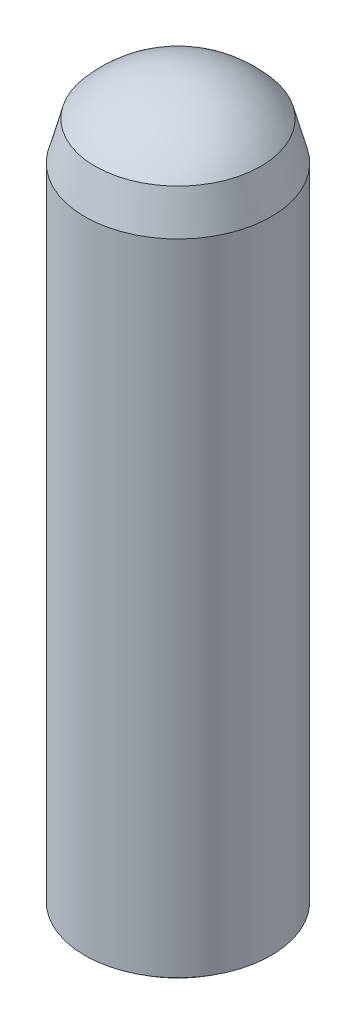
ISO-10303-21;
HEADER;
FILE_DESCRIPTION(('STEP AP214'),'2;1');
FILE_NAME('part.step','',(''),(''),'','','');
FILE_SCHEMA(('AUTOMOTIVE_DESIGN { 1 0 10303 214 1 1 1 1 }'));
ENDSEC;
DATA;
#1=APPLICATION_CONTEXT('core data for automotive mechanical design processes');
#2=APPLICATION_PROTOCOL_DEFINITION('international standard','automotive_design',2000,#1);
#3=PRODUCT_CONTEXT('',#1,'mechanical');
#4=PRODUCT('Part','Part','',(#3));
#5=PRODUCT_RELATED_PRODUCT_CATEGORY('part','',(#4));
#6=PRODUCT_DEFINITION_FORMATION('','',#4);
#7=PRODUCT_DEFINITION_CONTEXT('part definition',#1,'design');
#8=PRODUCT_DEFINITION('design','',#6,#7);
#9=PRODUCT_DEFINITION_SHAPE('','',#8);
#10=(LENGTH_UNIT() NAMED_UNIT(*) SI_UNIT(.MILLI.,.METRE.));
#11=(NAMED_UNIT(*) PLANE_ANGLE_UNIT() SI_UNIT($,.RADIAN.));
#12=(NAMED_UNIT(*) SI_UNIT($,.STERADIAN.) SOLID_ANGLE_UNIT());
#13=UNCERTAINTY_MEASURE_WITH_UNIT(LENGTH_MEASURE(1.E-05),#10,'distance_accuracy_value','');
#14=(GEOMETRIC_REPRESENTATION_CONTEXT(3) GLOBAL_UNCERTAINTY_ASSIGNED_CONTEXT((#13)) GLOBAL_UNIT_ASSIGNED_CONTEXT((#10,
#11,#12)) REPRESENTATION_CONTEXT('',''));
#15=CARTESIAN_POINT('',(0.,0.,0.));
#16=DIRECTION('',(0.,0.,1.));
#17=DIRECTION('',(1.,0.,0.));
#18=AXIS2_PLACEMENT_3D('',#15,#16,#17);
#19=CARTESIAN_POINT('',(0.,0.,0.));
#20=DIRECTION('',(0.,-1.,0.));
#21=DIRECTION('',(0.,0.,-1.));
#22=AXIS2_PLACEMENT_3D('',#19,#20,#21);
#23=PLANE('',#22);
#24=CARTESIAN_POINT('',(0.,0.,0.));
#25=DIRECTION('',(0.,-1.,0.));
#26=DIRECTION('',(0.,0.,-1.));
#27=AXIS2_PLACEMENT_3D('',#24,#25,#26);
#28=CIRCLE('',#27,0.0999999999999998);
#29=CARTESIAN_POINT('',(0.,0.,-0.0999999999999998));
#30=VERTEX_POINT('',#29);
#31=EDGE_CURVE('E10',#30,#30,#28,.T.);
#32=ORIENTED_EDGE('',*,*,#31,.T.);
#33=EDGE_LOOP('',(#32));
#34=FACE_BOUND('',#33,.T.);
#35=ADVANCED_FACE('F33',(#34),#23,.T.);
#36=CARTESIAN_POINT('',(0.,1.03347826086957,0.));
#37=DIRECTION('',(0.,-1.,0.));
#38=DIRECTION('',(0.,0.,-1.));
#39=AXIS2_PLACEMENT_3D('',#36,#37,#38);
#40=DEGENERATE_TOROIDAL_SURFACE('',#39,0.1,1.03347826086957,.T.);
#41=CARTESIAN_POINT('',(0.,0.23,0.));
#42=DIRECTION('',(0.,-1.,0.));
#43=DIRECTION('',(0.,0.,-1.));
#44=AXIS2_PLACEMENT_3D('',#41,#42,#43);
#45=CIRCLE('',#44,0.75);
#46=CARTESIAN_POINT('',(0.,0.23,-0.75));
#47=VERTEX_POINT('',#46);
#48=EDGE_CURVE('E39',#47,#47,#45,.T.);
#49=ORIENTED_EDGE('',*,*,#48,.T.);
#50=EDGE_LOOP('',(#49));
#51=FACE_BOUND('',#50,.T.);
#52=ORIENTED_EDGE('',*,*,#31,.F.);
#53=EDGE_LOOP('',(#52));
#54=FACE_BOUND('',#53,.T.);
#55=ADVANCED_FACE('F65',(#51,#54),#40,.T.);
#56=CARTESIAN_POINT('',(0.,0.,0.));
#57=DIRECTION('',(0.,-1.,0.));
#58=DIRECTION('',(0.,0.,-1.));
#59=AXIS2_PLACEMENT_3D('',#56,#57,#58);
#60=CYLINDRICAL_SURFACE('',#59,0.75);
#61=CARTESIAN_POINT('',(0.,5.38,0.));
#62=DIRECTION('',(0.,-1.,0.));
#63=DIRECTION('',(0.,0.,-1.));
#64=AXIS2_PLACEMENT_3D('',#61,#62,#63);
#65=CIRCLE('',#64,0.75);
#66=CARTESIAN_POINT('',(0.,5.38,-0.75));
#67=VERTEX_POINT('',#66);
#68=EDGE_CURVE('E43',#67,#67,#65,.T.);
#69=ORIENTED_EDGE('',*,*,#68,.T.);
#70=EDGE_LOOP('',(#69));
#71=FACE_BOUND('',#70,.T.);
#72=ORIENTED_EDGE('',*,*,#48,.F.);
#73=EDGE_LOOP('',(#72));
#74=FACE_BOUND('',#73,.T.);
#75=ADVANCED_FACE('F62',(#71,#74),#60,.T.);
#76=CARTESIAN_POINT('',(0.,5.38,0.));
#77=DIRECTION('',(0.,-1.,0.));
#78=DIRECTION('',(0.,0.,-1.));
#79=AXIS2_PLACEMENT_3D('',#76,#77,#78);
#80=CONICAL_SURFACE('',#79,0.75,0.26179938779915);
#81=CARTESIAN_POINT('',(0.,5.69,0.));
#82=DIRECTION('',(0.,-1.,0.));
#83=DIRECTION('',(0.,0.,-1.));
#84=AXIS2_PLACEMENT_3D('',#81,#82,#83);
#85=CIRCLE('',#84,0.666935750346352);
#86=CARTESIAN_POINT('',(0.,5.69,-0.666935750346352));
#87=VERTEX_POINT('',#86);
#88=EDGE_CURVE('E47',#87,#87,#85,.T.);
#89=ORIENTED_EDGE('',*,*,#88,.T.);
#90=EDGE_LOOP('',(#89));
#91=FACE_BOUND('',#90,.T.);
#92=ORIENTED_EDGE('',*,*,#68,.F.);
#93=EDGE_LOOP('',(#92));
#94=FACE_BOUND('',#93,.T.);
#95=ADVANCED_FACE('F53',(#91,#94),#80,.T.);
#96=CARTESIAN_POINT('',(0.,5.12757533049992,0.));
#97=DIRECTION('',(0.,-1.,0.));
#98=DIRECTION('',(1.,0.,0.));
#99=AXIS2_PLACEMENT_3D('',#96,#97,#98);
#100=SPHERICAL_SURFACE('',#99,0.872424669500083);
#101=ORIENTED_EDGE('',*,*,#88,.F.);
#102=EDGE_LOOP('',(#101));
#103=FACE_BOUND('',#102,.T.);
#104=ADVANCED_FACE('F56',(#103),#100,.T.);
#105=CLOSED_SHELL('',(#35,#55,#75,#95,#104));
#106=MANIFOLD_SOLID_BREP('B2',#105);
#107=ADVANCED_BREP_SHAPE_REPRESENTATION('',(#18,#106),#14);
#108=SHAPE_DEFINITION_REPRESENTATION(#9,#107);
ENDSEC;
END-ISO-10303-21;
